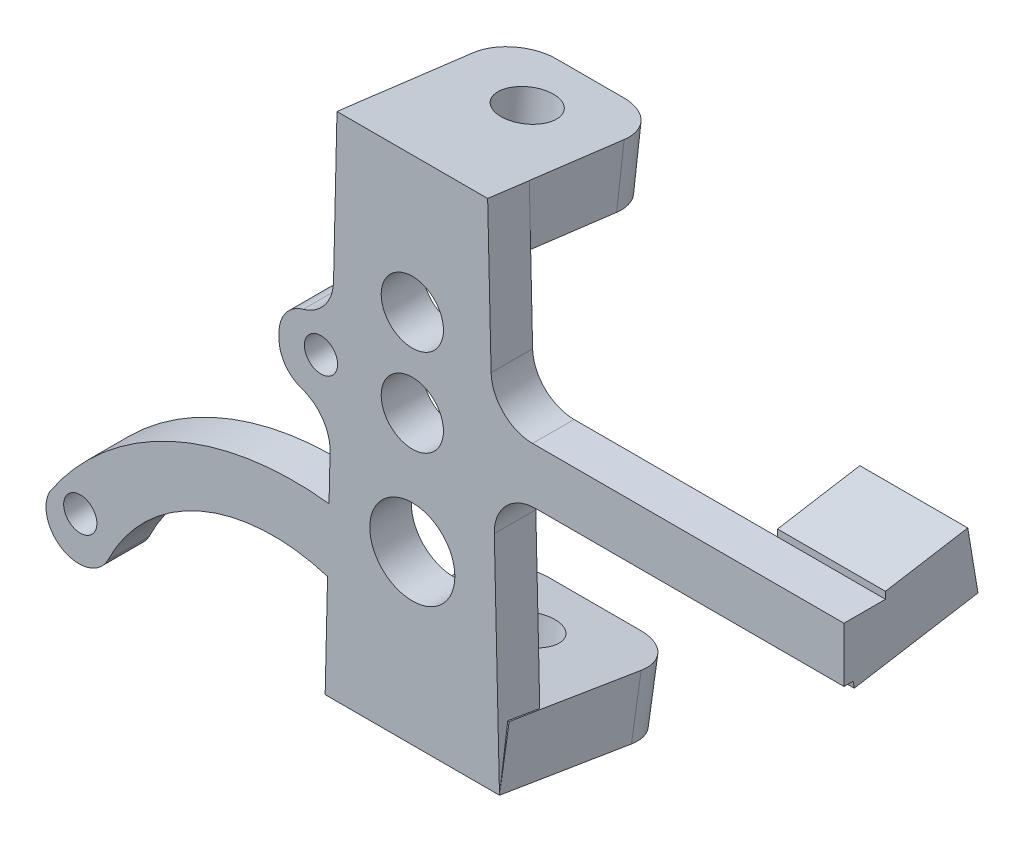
from build123d import *

# Parameters (mm, degrees)
SKETCH2_R           = 10.25
BOSS_EXTRUDE2_DEPTH = 80.8
EXTRUDE_THIN1_DEPTH = 21
EXTRUDE_THIN2_DEPTH = 18.15
BOSS_EXTRUDE5_DEPTH = 13
SKETCH9_R           = 4
BOSS_EXTRUDE6_DEPTH = 10
CUT_EXTRUDE2_START  = -10
SKETCH10_R          = 10.25
CUT_EXTRUDE2_DEPTH  = 10
SKETCH11_W          = 45.871340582
SKETCH11_H          = 66.469789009
CUT_EXTRUDE3_DEPTH  = 10
SKETCH12_W          = 64.891652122
SKETCH12_H          = 29.698533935
CUT_EXTRUDE4_DEPTH  = 10
SKETCH13_R          = 10.25
CUT_EXTRUDE5_DEPTH  = 182.519604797
SKETCH17_W          = 42
SKETCH17_H          = 14.4
BOSS_EXTRUDE7_DEPTH = 10
SKETCH16_R          = 6.35
CUT_EXTRUDE6_DEPTH  = 158.345728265
SKETCH15_R          = 6.35
CUT_EXTRUDE8_DEPTH  = 20
FILLET1_R           = 10
FILLET2_R           = 10
FILLET3_R           = 10
FILLET4_R           = 8
SKETCH18_R          = 7.5
CUT_EXTRUDE9_DEPTH  = 138.212787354
SKETCH19_W          = 28.445194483
SKETCH19_H          = 9.994981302
CUT_EXTRUDE10_DEPTH = 20


with BuildPart() as part:
    # Sketch2 → Boss-Extrude2 (new body)
    with BuildSketch(Plane.XY):
        Circle(SKETCH2_R)
    extrude(amount=BOSS_EXTRUDE2_DEPTH)



with BuildPart() as body_2:
    # Sketch4 → Extrude-Thin1 (new, symmetric)
    with BuildSketch(Plane(origin=(0, 0, 0), x_dir=(0, 0, -1), z_dir=(1, 0, 0))):
        Polygon((0, -40.3), (31.8, -45.5), (34.123852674, -31.288747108), (2.323852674, -26.088747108), align=None)
    extrude(amount=EXTRUDE_THIN1_DEPTH, both=True)


with BuildPart() as body_3:
    # Sketch6 → Extrude-Thin2 (new, symmetric)
    with BuildSketch(Plane(origin=(0, 0, 0), x_dir=(0, 0, -1), z_dir=(1, 0, 0))):
        Polygon((0, 82.8), (42.802293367, 77.4), (40.999856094, 63.113250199), (-1.802437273, 68.513250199), align=None)
    extrude(amount=EXTRUDE_THIN2_DEPTH, both=True)


with BuildPart() as body_4:
    # 3DSketch1 → Boss-Extrude5 (new, symmetric)
    with BuildSketch(Plane(origin=(91, 42.070109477, -29.820656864), x_dir=(0, -0.585682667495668, 0.8105404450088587), z_dir=(-1, 0, 0))):
        Polygon((0, 0), (6.666926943, -13.436967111), (33.748682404, 0), (27.081755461, 13.436967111), align=None)
    extrude(amount=BOSS_EXTRUDE5_DEPTH, both=True)


with BuildPart() as part_1:
    add(part.part)

    add(body_2.part)  # Boss-Extrude6 merges body 2

    add(body_3.part)  # Boss-Extrude6 merges body 3

    add(body_4.part)  # Boss-Extrude6 merges body 4
    # Sketch9 → Boss-Extrude6 (add)
    with BuildSketch(Plane.XY):
        with BuildLine():
            Line((18.15, 82.8), (-18.15, 82.8))
            Line((-18.15, 82.8), (-19.208042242, 37.1))
            Line((-19.208042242, 37.1), (-32.108456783, 37.1))
            Line((-32.108456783, 37.1), (-32.108456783, 21.25))
            Line((-32.108456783, 21.25), (-19.575, 21.25))
            Line((-19.575, 21.25), (-20.066978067, 0))
            ThreePointArc((-20.066978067, 0), (-58.116253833, -6.00095655), (-87.346806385, -31.087480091))
            ThreePointArc((-87.346806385, -31.087480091), (-84.035526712, -41.75550476), (-73.367502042, -38.444225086))
            ThreePointArc((-73.367502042, -38.444225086), (-51.178944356, -17.07625954), (-20.422480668, -15.355217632))
            Line((-20.422480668, -15.355217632), (-21, -40.3))
            Line((-21, -40.3), (21, -40.3))
            Line((21, -40.3), (19.513656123, 23.899624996))
            Line((19.513656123, 23.899624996), (104, 23.899624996))
            Line((104, 23.899624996), (104, 37.1))
            Line((104, 37.1), (19.208042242, 37.1))
            Line((19.208042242, 37.1), (18.15, 82.8))
        make_face()
        with Locations((-22, 30.1)):
            Circle(SKETCH9_R, mode=Mode.SUBTRACT)
        with Locations((-80, -32.1)):
            Circle(SKETCH9_R, mode=Mode.SUBTRACT)
    extrude(amount=-BOSS_EXTRUDE6_DEPTH)

    # Sketch10 → Cut-Extrude2 (cut)
    with BuildSketch(Plane.XY.offset(CUT_EXTRUDE2_START)):
        Circle(SKETCH10_R)
    extrude(amount=CUT_EXTRUDE2_DEPTH, mode=Mode.SUBTRACT)


with BuildPart() as cut_extrude2_piece_1:
    # of the separate pieces the step leaves, piece 1, a body of its own (cut_extrude2_pieces)
    add(part_1.part.solids().sort_by_distance((19.513656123, 23.899624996, 0))[0])

    # Sketch11 → Cut-Extrude3 (cut)
    with BuildSketch(Plane(origin=(0, 81.502744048, -10.282505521), x_dir=(1, 0, 0), z_dir=(0, 0.992135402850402, -0.12516925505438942))):
        with Locations((1.051096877, -1.360486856)):
            Rectangle(SKETCH11_W, SKETCH11_H)
    extrude(amount=CUT_EXTRUDE3_DEPTH, mode=Mode.SUBTRACT)

    # Sketch12 → Cut-Extrude4 (cut)
    with BuildSketch(Plane.XY):
        with Locations((-3.785375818, 78.638014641)):
            Rectangle(SKETCH12_W, SKETCH12_H)
    extrude(amount=CUT_EXTRUDE4_DEPTH, mode=Mode.SUBTRACT)

    # Sketch17 → Boss-Extrude7 (add)
    with BuildSketch(Plane(origin=(0, -6.249535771, -38.218314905), x_dir=(-1, 0, 0), z_dir=(0, -0.1613786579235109, -0.9868925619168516))):
        with Locations((0, -32.571770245)):
            Rectangle(SKETCH17_W, SKETCH17_H)
    extrude(amount=BOSS_EXTRUDE7_DEPTH)

    # Sketch16 → Cut-Extrude6 (cut, through all)
    with BuildSketch(Plane(origin=(0, -25.039211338, 4.094462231), x_dir=(1, 0, 0), z_dir=(0, 0.9868925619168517, -0.1613786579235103))):
        with Locations(Location((0, 32.631658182, 0), (0, 0, 270))):
            Circle(SKETCH16_R)
    extrude(amount=-CUT_EXTRUDE6_DEPTH, mode=Mode.SUBTRACT)

    # Sketch15 → Cut-Extrude8 (cut)
    with BuildSketch(Plane(origin=(0, 81.502744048, -10.282505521), x_dir=(1, 0, 0), z_dir=(0, 0.992135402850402, -0.12516925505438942))):
        with Locations(Location((0, 17.531980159, 0), (0, 0, 270))):
            Circle(SKETCH15_R)
    extrude(amount=-CUT_EXTRUDE8_DEPTH, mode=Mode.SUBTRACT)

    # Fillet1
    fillet1_edges = [cut_extrude2_piece_1.edges().sort_by_distance(p)[0] for p in [
        (18.15, 70.256625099, -41.901074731),
        (-18.15, 70.256625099, -41.901074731),
    ]]
    fillet(fillet1_edges, radius=FILLET1_R)

    # Fillet2
    fillet2_edges = [cut_extrude2_piece_1.edges().sort_by_distance(p)[0] for p in [
        (-21, -40.008160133, -42.830851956),
        (21, -40.008160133, -42.830851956),
    ]]
    fillet(fillet2_edges, radius=FILLET2_R)

    # Fillet3
    fillet3_edges = [cut_extrude2_piece_1.edges().sort_by_distance(p)[0] for p in [
        (19.208042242, 37.1, -5),
        (-19.575, 21.25, -5),
        (-19.208042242, 37.1, -5),
        (19.513656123, 23.899624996, -5),
    ]]
    fillet(fillet3_edges, radius=FILLET3_R)

    # Fillet4
    fillet4_edges = [cut_extrude2_piece_1.edges().sort_by_distance(p)[0] for p in [
        (-32.108456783, 21.25, -5),
        (-32.108456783, 37.1, -5),
    ]]
    fillet(fillet4_edges, radius=FILLET4_R)

    # Sketch18 → Cut-Extrude9 (cut, through all)
    with BuildSketch(Plane(origin=(0, 0, -10), x_dir=(-1, 0, 0), z_dir=(0, 0, -1))):
        with Locations((0, 49.994119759)):
            Circle(SKETCH18_R)
        with Locations((0, 28.932485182)):
            Circle(SKETCH18_R)
    extrude(amount=-CUT_EXTRUDE9_DEPTH, mode=Mode.SUBTRACT)

    # Sketch19 → Cut-Extrude10 (cut)
    with BuildSketch(Plane(origin=(0, 37.1, 0), x_dir=(1, 0, 0), z_dir=(0, 1, 0))):
        with Locations((92.222597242, 4.997490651)):
            Rectangle(SKETCH19_W, SKETCH19_H)
    extrude(amount=CUT_EXTRUDE10_DEPTH, mode=Mode.SUBTRACT)


with BuildPart() as cut_extrude2_piece_2:
    # of the separate pieces the step leaves, piece 2, a body of its own (cut_extrude2_pieces)
    add(part_1.part.solids().sort_by_distance((10.25, 0, 80.8))[0])

    # Sketch13 → Cut-Extrude5 (cut, through all)
    with BuildSketch(Plane.XY.offset(80.8)):
        Circle(SKETCH13_R)
    extrude(amount=-CUT_EXTRUDE5_DEPTH, mode=Mode.SUBTRACT)


solid = cut_extrude2_piece_1.part
